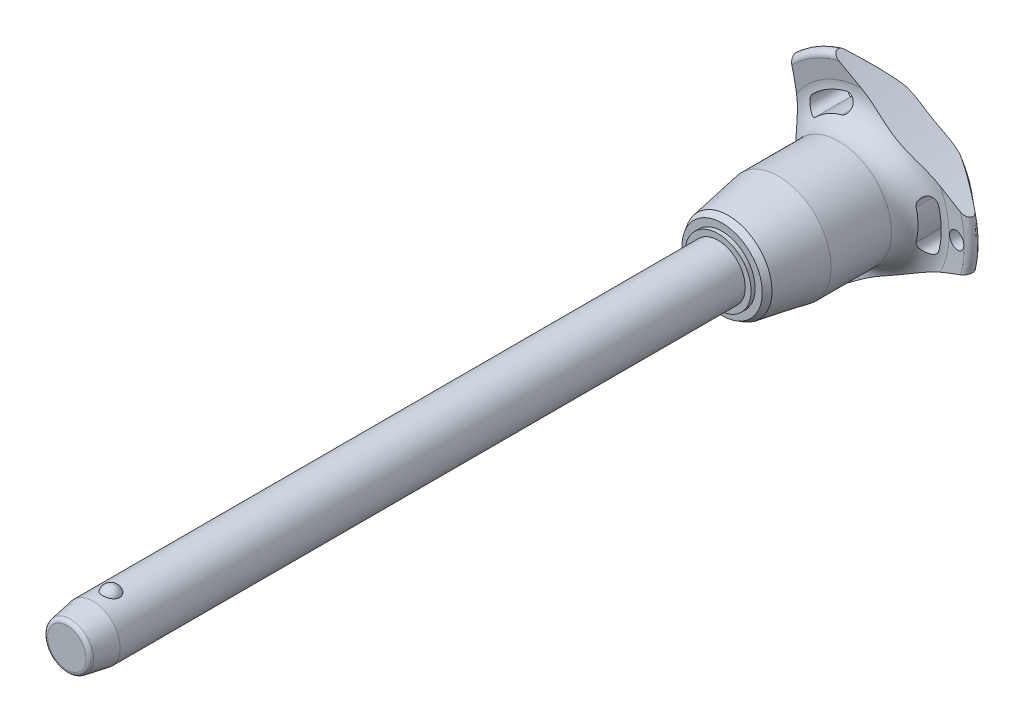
from build123d import *

# Parameters (mm, degrees)
SKETCH1_R           = 5
BOSS_EXTRUDE1_DEPTH = 110
SKETCH2_R           = 4.25
BOSS_EXTRUDE2_DEPTH = 33.3
BOSS_EXTRUDE3_START = 9.6
SKETCH1_2_R         = 5
BOSS_EXTRUDE3_DEPTH = 9.6
CHAMFER1_SIZE       = 4.8
CHAMFER1_SIZE2      = 0.846369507
FILLET1_R           = 0.75
SKETCH6_R           = 102.8
CUT_EXTRUDE1_DEPTH  = 146.959729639
CIRPATTERN1_COUNT   = 3
SKETCH7_R           = 1.5
CUT_EXTRUDE2_DEPTH  = 146.848877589


with BuildPart() as part:
    # Sketch1 → Boss-Extrude1 (new body)
    with BuildSketch(Plane.XY):
        Circle(SKETCH1_R)
    extrude(amount=-BOSS_EXTRUDE1_DEPTH)

    # Sketch2 → Boss-Extrude2 (add)
    with BuildSketch(Plane(origin=(0, 0, -110), x_dir=(-1, 0, 0), z_dir=(0, 0, -1))):
        Circle(SKETCH2_R)
    extrude(amount=BOSS_EXTRUDE2_DEPTH)

    # Sketch3 → Revolve1 (revolve)
    with BuildSketch(Plane(origin=(0, 0, 0), x_dir=(0, 0, -1), z_dir=(1, 0, 0))):
        with BuildLine():
            Line((-1.516575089, 6), (-1.516575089, 2.7))
            ThreePointArc((-1.516575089, 2.7), (0.133424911, 4.35), (-1.516575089, 6))
        make_face()
        with BuildLine():
            Line((-1.516575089, -2.7), (-1.516575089, -6))
            ThreePointArc((-1.516575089, -6), (0.133424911, -4.35), (-1.516575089, -2.7))
        make_face()
    revolve(axis=Axis((0, -2.7, 1.516575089), (0, 1, 0)))

    # Sketch1_2 → Boss-Extrude3 (add)
    with BuildSketch(Plane.XY.offset(BOSS_EXTRUDE3_START)):
        Circle(SKETCH1_2_R)
    extrude(amount=-BOSS_EXTRUDE3_DEPTH)

    # Chamfer1
    chamfer1_edges = [part.edges().sort_by_distance(p)[0] for p in [
        (-5, 0, 9.6),
    ]]
    chamfer1_side = [part.faces().sort_by_distance(p)[0] for p in [
        (-5, 0, -50.2),
    ]]
    chamfer(chamfer1_edges, length=CHAMFER1_SIZE, length2=CHAMFER1_SIZE2, reference=chamfer1_side[0])

    # Fillet1
    fillet1_edges = [part.edges().sort_by_distance(p)[0] for p in [
        (-4.153630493, 0, 9.6),
        (4.25, 0, -143.3),
    ]]
    fillet(fillet1_edges, radius=FILLET1_R)

    # Sketch4 → Revolve2 (revolve)
    with BuildSketch(Plane(origin=(0, 0, 0), x_dir=(0, 0, -1), z_dir=(1, 0, 0)), mode=Mode.PRIVATE) as revolve2_sk:
        Polygon((110, 0), (110, 6.067402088), (110.75, 6.067402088), (110.75, 7.371950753), (111.879772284, 8.024225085), (121.1, 9.65), (132.2, 9.65), (132.2, 0), align=None)
    revolve(revolve2_sk.sketch.rotate(Axis((0, 0, -132.2), (0, 0, 1)), 90), axis=Axis((0, 0, -132.2), (0, 0, 1)))

    # Sketch5 → Revolve3 (revolve)
    with BuildSketch(Plane(origin=(0, 0, 0), x_dir=(0, 0, -1), z_dir=(1, 0, 0)), mode=Mode.PRIVATE) as revolve3_sk:
        with BuildLine():
            Line((137.16082631, 15.274661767), (136.757834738, 18.475067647))
            ThreePointArc((136.757834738, 18.475067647), (137.349836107, 19.516443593), (138.516044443, 19.24278761))
            Line((138.516044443, 19.24278761), (142.835691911, 14.094832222))
            ThreePointArc((142.835691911, 14.094832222), (143.3, 12.689260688), (142.67067517, 11.349423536))
            ThreePointArc((142.67067517, 11.349423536), (139.033110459, 6.185112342), (137.75, 0))
            Line((137.75, 0), (132.2, 0))
            Line((132.2, 0), (132.2, 9.65))
            ThreePointArc((132.2, 9.65), (135.949887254, 11.342683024), (137.16082631, 15.274661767))
        make_face()
    revolve(revolve3_sk.sketch.rotate(Axis((0, 0, -137.75), (0, 0, 1)), 90), axis=Axis((0, 0, -137.75), (0, 0, 1)))

    # Sketch6 → Cut-Extrude1 (cut, through all)
    with BuildSketch(Plane.XY):
        with Locations((-115.2, 0)):
            Circle(SKETCH6_R)
        with BuildLine():
            ThreePointArc((13.411913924, -3.529271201), (13.868496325, 0), (13.411913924, 3.529271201))
            ThreePointArc((13.411913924, 3.529271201), (11.694200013, 4.531299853), (10.692171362, 2.813585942))
            ThreePointArc((10.692171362, 2.813585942), (11.056165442, 0), (10.692171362, -2.813585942))
            ThreePointArc((10.692171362, -2.813585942), (11.694200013, -4.531299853), (13.411913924, -3.529271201))
        make_face()
    cut_extrude1 = extrude(amount=-CUT_EXTRUDE1_DEPTH, mode=Mode.SUBTRACT)

    # CirPattern1: Cut-Extrude1 ×3 about axis
    cirpattern1_axis = Axis((0, 0, 0), (0, 0, 1))
    for i in range(1, CIRPATTERN1_COUNT):
        add(cut_extrude1.rotate(cirpattern1_axis, i * 360 / CIRPATTERN1_COUNT), mode=Mode.SUBTRACT)

    # Sketch7 → Cut-Extrude2 (cut, through all)
    with BuildSketch(Plane.XY):
        with Locations(Location((16.868496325, 0, 0), (0, 0, 225.467095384))):
            Circle(SKETCH7_R)
    extrude(amount=-CUT_EXTRUDE2_DEPTH, mode=Mode.SUBTRACT)


solid = part.part
